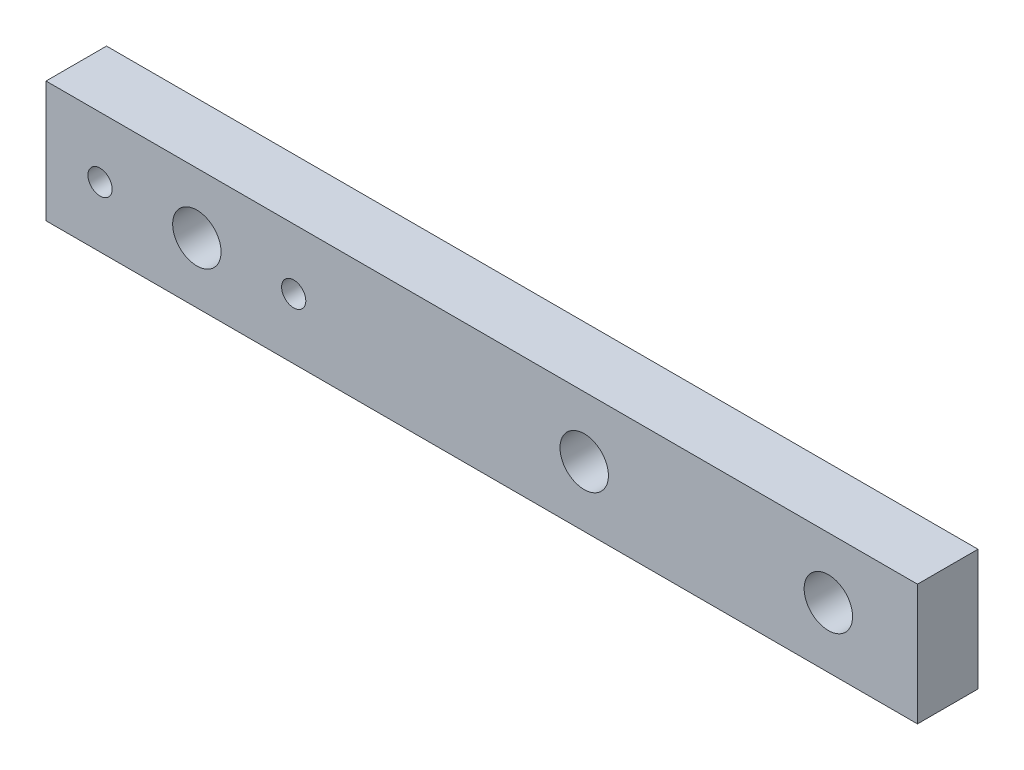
from build123d import *

# Parameters (mm, degrees)
SKETCH1_W           = 72
SKETCH1_H           = 10
BOSS_EXTRUDE1_DEPTH = 5
SKETCH2_R           = 1
SKETCH2_R_2         = 2
CUT_EXTRUDE1_DEPTH  = 5


with BuildPart() as part:
    # Sketch1 → Boss-Extrude1 (new body)
    with BuildSketch(Plane.XY):
        with Locations((-1, 0)):
            Rectangle(SKETCH1_W, SKETCH1_H)
    extrude(amount=BOSS_EXTRUDE1_DEPTH)

    # Sketch2 → Cut-Extrude1 (cut)
    with BuildSketch(Plane.XY.offset(5)):
        with Locations((-32.535453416, 0)):
            Circle(SKETCH2_R)
        with Locations((-24.535453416, 0)):
            Circle(SKETCH2_R_2)
        with Locations((-16.535453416, 0)):
            Circle(SKETCH2_R)
        with Locations((7.464546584, 0)):
            Circle(SKETCH2_R_2)
        with Locations((27.637952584, 0)):
            Circle(SKETCH2_R_2)
    extrude(amount=-CUT_EXTRUDE1_DEPTH, mode=Mode.SUBTRACT)


solid = part.part
